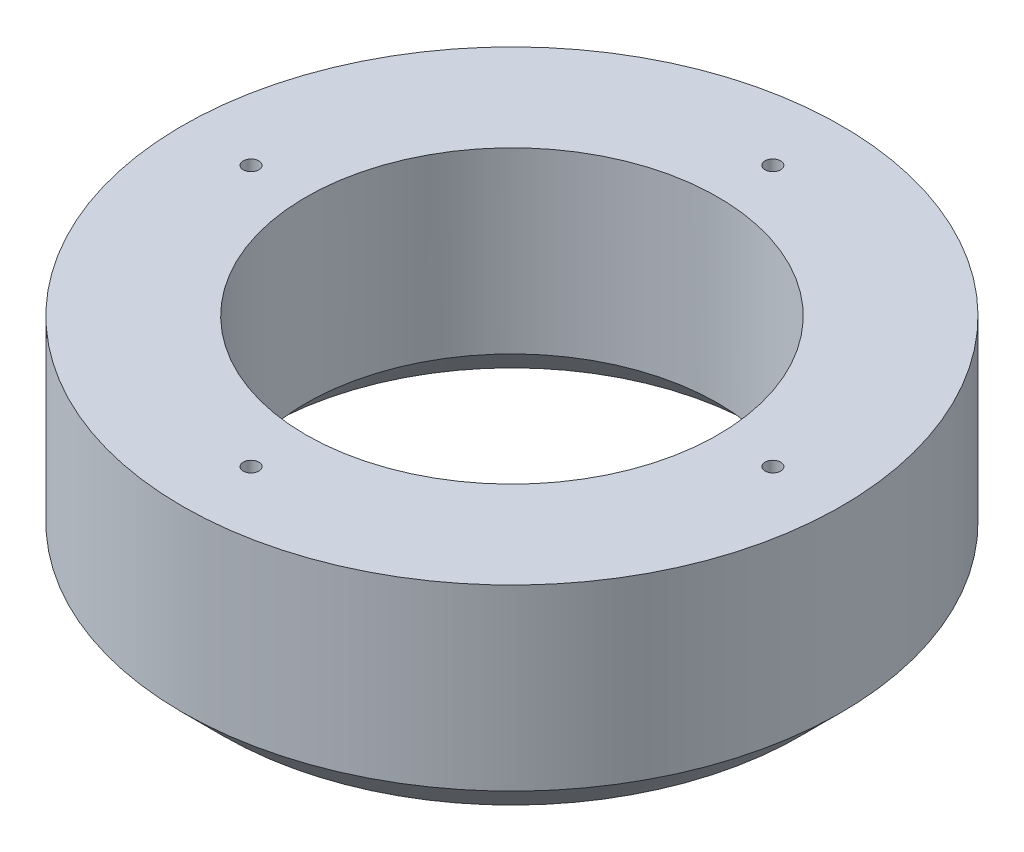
from build123d import *

# Parameters (mm, degrees)
SKETCH1_W          = 228.6
SKETCH1_H          = 406.4
CHAMFER1_SIZE      = 76.2
CHAMFER2_SIZE      = 76.2
SKETCH2_R          = 14.4145
CUT_EXTRUDE1_DEPTH = 954.092482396
CIRPATTERN1_COUNT  = 4


with BuildPart() as part:
    # Sketch1 → Revolve1 (revolve)
    with BuildSketch(Plane.XY, mode=Mode.PRIVATE) as revolve1_sk:
        with Locations((495.3, -203.2)):
            Rectangle(SKETCH1_W, SKETCH1_H)
    revolve(revolve1_sk.sketch.rotate(Axis((0, 0, 0), (0, -1, 0)), 90), axis=Axis((0, 0, 0), (0, -1, 0)))

    # Chamfer1
    chamfer1_edges = [part.edges().sort_by_distance(p)[0] for p in [
        (0, -406.4, -609.6),
    ]]
    chamfer(chamfer1_edges, length=CHAMFER1_SIZE)

    # Chamfer2
    chamfer2_edges = [part.edges().sort_by_distance(p)[0] for p in [
        (0, -406.4, -381),
    ]]
    chamfer(chamfer2_edges, length=CHAMFER2_SIZE)

    # Sketch2 → Cut-Extrude1 (cut, through all)
    with BuildSketch(Plane(origin=(0, 0, 0), x_dir=(-1, 0, 0), z_dir=(0, 1, 0))):
        with Locations(Location((-482.6, 0, 0), (0, 0, 90))):
            Circle(SKETCH2_R)
    cut_extrude1 = extrude(amount=-CUT_EXTRUDE1_DEPTH, mode=Mode.SUBTRACT)

    # CirPattern1: Cut-Extrude1 ×4 about axis
    cirpattern1_axis = Axis((0, 0, 0), (0, 1, 0))
    for i in range(1, CIRPATTERN1_COUNT):
        add(cut_extrude1.rotate(cirpattern1_axis, i * 360 / CIRPATTERN1_COUNT), mode=Mode.SUBTRACT)


solid = part.part
